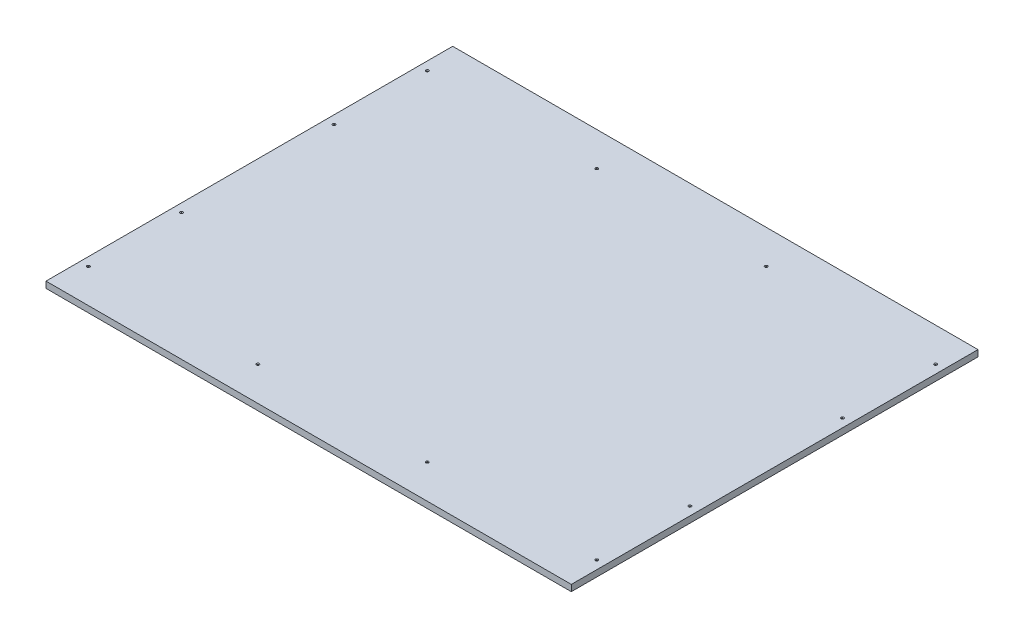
ISO-10303-21;
HEADER;
FILE_DESCRIPTION(('STEP AP214'),'2;1');
FILE_NAME('part.step','',(''),(''),'','','');
FILE_SCHEMA(('AUTOMOTIVE_DESIGN { 1 0 10303 214 1 1 1 1 }'));
ENDSEC;
DATA;
#1=APPLICATION_CONTEXT('core data for automotive mechanical design processes');
#2=APPLICATION_PROTOCOL_DEFINITION('international standard','automotive_design',2000,#1);
#3=PRODUCT_CONTEXT('',#1,'mechanical');
#4=PRODUCT('Part','Part','',(#3));
#5=PRODUCT_RELATED_PRODUCT_CATEGORY('part','',(#4));
#6=PRODUCT_DEFINITION_FORMATION('','',#4);
#7=PRODUCT_DEFINITION_CONTEXT('part definition',#1,'design');
#8=PRODUCT_DEFINITION('design','',#6,#7);
#9=PRODUCT_DEFINITION_SHAPE('','',#8);
#10=(LENGTH_UNIT() NAMED_UNIT(*) SI_UNIT(.MILLI.,.METRE.));
#11=(NAMED_UNIT(*) PLANE_ANGLE_UNIT() SI_UNIT($,.RADIAN.));
#12=(NAMED_UNIT(*) SI_UNIT($,.STERADIAN.) SOLID_ANGLE_UNIT());
#13=UNCERTAINTY_MEASURE_WITH_UNIT(LENGTH_MEASURE(1.E-05),#10,'distance_accuracy_value','');
#14=(GEOMETRIC_REPRESENTATION_CONTEXT(3) GLOBAL_UNCERTAINTY_ASSIGNED_CONTEXT((#13)) GLOBAL_UNIT_ASSIGNED_CONTEXT((#10,
#11,#12)) REPRESENTATION_CONTEXT('',''));
#15=CARTESIAN_POINT('',(0.,0.,0.));
#16=DIRECTION('',(0.,0.,1.));
#17=DIRECTION('',(1.,0.,0.));
#18=AXIS2_PLACEMENT_3D('',#15,#16,#17);
#19=CARTESIAN_POINT('',(-1219.2,19.05,-609.6));
#20=DIRECTION('',(0.,0.,1.));
#21=DIRECTION('',(1.,0.,0.));
#22=AXIS2_PLACEMENT_3D('',#19,#20,#21);
#23=PLANE('',#22);
#24=DIRECTION('',(-1.,0.,0.));
#25=VECTOR('',#24,1.);
#26=CARTESIAN_POINT('',(-1219.2,19.05,-609.6));
#27=LINE('',#26,#25);
#28=CARTESIAN_POINT('',(355.6,19.05,-609.6));
#29=VERTEX_POINT('',#28);
#30=CARTESIAN_POINT('',(-1219.2,19.05,-609.6));
#31=VERTEX_POINT('',#30);
#32=EDGE_CURVE('E84',#29,#31,#27,.T.);
#33=ORIENTED_EDGE('',*,*,#32,.F.);
#34=DIRECTION('',(0.,1.,0.));
#35=VECTOR('',#34,1.);
#36=CARTESIAN_POINT('',(355.6,0.,-609.6));
#37=LINE('',#36,#35);
#38=CARTESIAN_POINT('',(355.6,0.,-609.6));
#39=VERTEX_POINT('',#38);
#40=EDGE_CURVE('E91',#39,#29,#37,.T.);
#41=ORIENTED_EDGE('',*,*,#40,.F.);
#42=DIRECTION('',(-1.,0.,0.));
#43=VECTOR('',#42,1.);
#44=CARTESIAN_POINT('',(-1219.2,0.,-609.6));
#45=LINE('',#44,#43);
#46=CARTESIAN_POINT('',(-1219.2,0.,-609.6));
#47=VERTEX_POINT('',#46);
#48=EDGE_CURVE('E76',#39,#47,#45,.T.);
#49=ORIENTED_EDGE('',*,*,#48,.T.);
#50=DIRECTION('',(0.,-1.,0.));
#51=VECTOR('',#50,1.);
#52=CARTESIAN_POINT('',(-1219.2,19.05,-609.6));
#53=LINE('',#52,#51);
#54=EDGE_CURVE('E11',#31,#47,#53,.T.);
#55=ORIENTED_EDGE('',*,*,#54,.F.);
#56=EDGE_LOOP('',(#33,#41,#49,#55));
#57=FACE_BOUND('',#56,.T.);
#58=ADVANCED_FACE('F32',(#57),#23,.F.);
#59=CARTESIAN_POINT('',(-1219.2,19.05,-609.6));
#60=DIRECTION('',(1.,0.,0.));
#61=DIRECTION('',(0.,0.,-1.));
#62=AXIS2_PLACEMENT_3D('',#59,#60,#61);
#63=PLANE('',#62);
#64=DIRECTION('',(0.,0.,1.));
#65=VECTOR('',#64,1.);
#66=CARTESIAN_POINT('',(-1219.2,0.,-609.6));
#67=LINE('',#66,#65);
#68=CARTESIAN_POINT('',(-1219.2,0.,609.6));
#69=VERTEX_POINT('',#68);
#70=EDGE_CURVE('E67',#47,#69,#67,.T.);
#71=ORIENTED_EDGE('',*,*,#70,.T.);
#72=DIRECTION('',(0.,-1.,0.));
#73=VECTOR('',#72,1.);
#74=CARTESIAN_POINT('',(-1219.2,19.05,609.6));
#75=LINE('',#74,#73);
#76=CARTESIAN_POINT('',(-1219.2,19.05,609.6));
#77=VERTEX_POINT('',#76);
#78=EDGE_CURVE('E39',#77,#69,#75,.T.);
#79=ORIENTED_EDGE('',*,*,#78,.F.);
#80=DIRECTION('',(0.,0.,1.));
#81=VECTOR('',#80,1.);
#82=CARTESIAN_POINT('',(-1219.2,19.05,-609.6));
#83=LINE('',#82,#81);
#84=EDGE_CURVE('E55',#31,#77,#83,.T.);
#85=ORIENTED_EDGE('',*,*,#84,.F.);
#86=ORIENTED_EDGE('',*,*,#54,.T.);
#87=EDGE_LOOP('',(#71,#79,#85,#86));
#88=FACE_BOUND('',#87,.T.);
#89=ADVANCED_FACE('F69',(#88),#63,.F.);
#90=CARTESIAN_POINT('',(-1219.2,19.05,609.6));
#91=DIRECTION('',(0.,0.,-1.));
#92=DIRECTION('',(-1.,0.,0.));
#93=AXIS2_PLACEMENT_3D('',#90,#91,#92);
#94=PLANE('',#93);
#95=DIRECTION('',(1.,0.,0.));
#96=VECTOR('',#95,1.);
#97=CARTESIAN_POINT('',(-1219.2,0.,609.6));
#98=LINE('',#97,#96);
#99=CARTESIAN_POINT('',(355.600000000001,0.,609.6));
#100=VERTEX_POINT('',#99);
#101=EDGE_CURVE('E75',#69,#100,#98,.T.);
#102=ORIENTED_EDGE('',*,*,#101,.T.);
#103=DIRECTION('',(0.,1.,0.));
#104=VECTOR('',#103,1.);
#105=CARTESIAN_POINT('',(355.600000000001,0.,609.6));
#106=LINE('',#105,#104);
#107=CARTESIAN_POINT('',(355.600000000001,19.05,609.6));
#108=VERTEX_POINT('',#107);
#109=EDGE_CURVE('E46',#100,#108,#106,.T.);
#110=ORIENTED_EDGE('',*,*,#109,.T.);
#111=DIRECTION('',(1.,0.,0.));
#112=VECTOR('',#111,1.);
#113=CARTESIAN_POINT('',(-1219.2,19.05,609.6));
#114=LINE('',#113,#112);
#115=EDGE_CURVE('E81',#77,#108,#114,.T.);
#116=ORIENTED_EDGE('',*,*,#115,.F.);
#117=ORIENTED_EDGE('',*,*,#78,.T.);
#118=EDGE_LOOP('',(#102,#110,#116,#117));
#119=FACE_BOUND('',#118,.T.);
#120=ADVANCED_FACE('F80',(#119),#94,.F.);
#121=CARTESIAN_POINT('',(0.,19.05,0.));
#122=DIRECTION('',(0.,1.,0.));
#123=DIRECTION('',(0.,0.,1.));
#124=AXIS2_PLACEMENT_3D('',#121,#122,#123);
#125=PLANE('',#124);
#126=CARTESIAN_POINT('',(-1193.8,19.05,508.));
#127=DIRECTION('',(0.,1.,0.));
#128=DIRECTION('',(0.,0.,1.));
#129=AXIS2_PLACEMENT_3D('',#126,#127,#128);
#130=CIRCLE('',#129,4.21640000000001);
#131=CARTESIAN_POINT('',(-1193.8,19.05,512.2164));
#132=VERTEX_POINT('',#131);
#133=EDGE_CURVE('E203',#132,#132,#130,.T.);
#134=ORIENTED_EDGE('',*,*,#133,.F.);
#135=EDGE_LOOP('',(#134));
#136=FACE_BOUND('',#135,.T.);
#137=CARTESIAN_POINT('',(-685.8,19.05,508.));
#138=DIRECTION('',(0.,1.,0.));
#139=DIRECTION('',(0.,0.,1.));
#140=AXIS2_PLACEMENT_3D('',#137,#138,#139);
#141=CIRCLE('',#140,4.21640000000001);
#142=CARTESIAN_POINT('',(-685.8,19.05,512.2164));
#143=VERTEX_POINT('',#142);
#144=EDGE_CURVE('E194',#143,#143,#141,.T.);
#145=ORIENTED_EDGE('',*,*,#144,.F.);
#146=EDGE_LOOP('',(#145));
#147=FACE_BOUND('',#146,.T.);
#148=CARTESIAN_POINT('',(-177.8,19.05,508.));
#149=DIRECTION('',(0.,1.,0.));
#150=DIRECTION('',(0.,0.,1.));
#151=AXIS2_PLACEMENT_3D('',#148,#149,#150);
#152=CIRCLE('',#151,4.21640000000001);
#153=CARTESIAN_POINT('',(-177.8,19.05,512.2164));
#154=VERTEX_POINT('',#153);
#155=EDGE_CURVE('E185',#154,#154,#152,.T.);
#156=ORIENTED_EDGE('',*,*,#155,.F.);
#157=EDGE_LOOP('',(#156));
#158=FACE_BOUND('',#157,.T.);
#159=CARTESIAN_POINT('',(330.2,19.05,508.));
#160=DIRECTION('',(0.,1.,0.));
#161=DIRECTION('',(0.,0.,1.));
#162=AXIS2_PLACEMENT_3D('',#159,#160,#161);
#163=CIRCLE('',#162,4.21640000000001);
#164=CARTESIAN_POINT('',(330.2,19.05,512.2164));
#165=VERTEX_POINT('',#164);
#166=EDGE_CURVE('E176',#165,#165,#163,.T.);
#167=ORIENTED_EDGE('',*,*,#166,.F.);
#168=EDGE_LOOP('',(#167));
#169=FACE_BOUND('',#168,.T.);
#170=CARTESIAN_POINT('',(-1193.8,19.05,-228.6));
#171=DIRECTION('',(0.,1.,0.));
#172=DIRECTION('',(0.,0.,1.));
#173=AXIS2_PLACEMENT_3D('',#170,#171,#172);
#174=CIRCLE('',#173,4.21640000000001);
#175=CARTESIAN_POINT('',(-1193.8,19.05,-224.3836));
#176=VERTEX_POINT('',#175);
#177=EDGE_CURVE('E167',#176,#176,#174,.T.);
#178=ORIENTED_EDGE('',*,*,#177,.F.);
#179=EDGE_LOOP('',(#178));
#180=FACE_BOUND('',#179,.T.);
#181=CARTESIAN_POINT('',(-1193.8,19.05,228.6));
#182=DIRECTION('',(0.,1.,0.));
#183=DIRECTION('',(0.,0.,1.));
#184=AXIS2_PLACEMENT_3D('',#181,#182,#183);
#185=CIRCLE('',#184,4.21640000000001);
#186=CARTESIAN_POINT('',(-1193.8,19.05,232.8164));
#187=VERTEX_POINT('',#186);
#188=EDGE_CURVE('E158',#187,#187,#185,.T.);
#189=ORIENTED_EDGE('',*,*,#188,.F.);
#190=EDGE_LOOP('',(#189));
#191=FACE_BOUND('',#190,.T.);
#192=CARTESIAN_POINT('',(330.200000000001,19.05,228.6));
#193=DIRECTION('',(0.,1.,0.));
#194=DIRECTION('',(0.,0.,1.));
#195=AXIS2_PLACEMENT_3D('',#192,#193,#194);
#196=CIRCLE('',#195,4.21640000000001);
#197=CARTESIAN_POINT('',(330.200000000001,19.05,232.8164));
#198=VERTEX_POINT('',#197);
#199=EDGE_CURVE('E149',#198,#198,#196,.T.);
#200=ORIENTED_EDGE('',*,*,#199,.F.);
#201=EDGE_LOOP('',(#200));
#202=FACE_BOUND('',#201,.T.);
#203=CARTESIAN_POINT('',(330.2,19.05,-228.6));
#204=DIRECTION('',(0.,1.,0.));
#205=DIRECTION('',(0.,0.,1.));
#206=AXIS2_PLACEMENT_3D('',#203,#204,#205);
#207=CIRCLE('',#206,4.21640000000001);
#208=CARTESIAN_POINT('',(330.2,19.05,-224.3836));
#209=VERTEX_POINT('',#208);
#210=EDGE_CURVE('E140',#209,#209,#207,.T.);
#211=ORIENTED_EDGE('',*,*,#210,.F.);
#212=EDGE_LOOP('',(#211));
#213=FACE_BOUND('',#212,.T.);
#214=CARTESIAN_POINT('',(-1193.8,19.05,-508.));
#215=DIRECTION('',(0.,1.,0.));
#216=DIRECTION('',(0.,0.,1.));
#217=AXIS2_PLACEMENT_3D('',#214,#215,#216);
#218=CIRCLE('',#217,4.21640000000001);
#219=CARTESIAN_POINT('',(-1193.8,19.05,-503.7836));
#220=VERTEX_POINT('',#219);
#221=EDGE_CURVE('E131',#220,#220,#218,.T.);
#222=ORIENTED_EDGE('',*,*,#221,.F.);
#223=EDGE_LOOP('',(#222));
#224=FACE_BOUND('',#223,.T.);
#225=CARTESIAN_POINT('',(-685.8,19.05,-508.));
#226=DIRECTION('',(0.,1.,0.));
#227=DIRECTION('',(0.,0.,1.));
#228=AXIS2_PLACEMENT_3D('',#225,#226,#227);
#229=CIRCLE('',#228,4.21640000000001);
#230=CARTESIAN_POINT('',(-685.8,19.05,-503.7836));
#231=VERTEX_POINT('',#230);
#232=EDGE_CURVE('E122',#231,#231,#229,.T.);
#233=ORIENTED_EDGE('',*,*,#232,.F.);
#234=EDGE_LOOP('',(#233));
#235=FACE_BOUND('',#234,.T.);
#236=CARTESIAN_POINT('',(-177.8,19.05,-508.));
#237=DIRECTION('',(0.,1.,0.));
#238=DIRECTION('',(0.,0.,1.));
#239=AXIS2_PLACEMENT_3D('',#236,#237,#238);
#240=CIRCLE('',#239,4.21640000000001);
#241=CARTESIAN_POINT('',(-177.8,19.05,-503.7836));
#242=VERTEX_POINT('',#241);
#243=EDGE_CURVE('E113',#242,#242,#240,.T.);
#244=ORIENTED_EDGE('',*,*,#243,.F.);
#245=EDGE_LOOP('',(#244));
#246=FACE_BOUND('',#245,.T.);
#247=CARTESIAN_POINT('',(330.2,19.05,-508.));
#248=DIRECTION('',(0.,1.,0.));
#249=DIRECTION('',(0.,0.,1.));
#250=AXIS2_PLACEMENT_3D('',#247,#248,#249);
#251=CIRCLE('',#250,4.21640000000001);
#252=CARTESIAN_POINT('',(330.2,19.05,-503.7836));
#253=VERTEX_POINT('',#252);
#254=EDGE_CURVE('E104',#253,#253,#251,.T.);
#255=ORIENTED_EDGE('',*,*,#254,.F.);
#256=EDGE_LOOP('',(#255));
#257=FACE_BOUND('',#256,.T.);
#258=DIRECTION('',(0.,0.,1.));
#259=VECTOR('',#258,1.);
#260=CARTESIAN_POINT('',(355.6,19.05,-609.6));
#261=LINE('',#260,#259);
#262=EDGE_CURVE('E95',#29,#108,#261,.T.);
#263=ORIENTED_EDGE('',*,*,#262,.F.);
#264=ORIENTED_EDGE('',*,*,#32,.T.);
#265=ORIENTED_EDGE('',*,*,#84,.T.);
#266=ORIENTED_EDGE('',*,*,#115,.T.);
#267=EDGE_LOOP('',(#263,#264,#265,#266));
#268=FACE_BOUND('',#267,.T.);
#269=ADVANCED_FACE('F209',(#136,#147,#158,#169,#180,#191,#202,#213,#224,#235,#246,#257,#268),
#125,.T.);
#270=CARTESIAN_POINT('',(0.,0.,0.));
#271=DIRECTION('',(0.,1.,0.));
#272=DIRECTION('',(0.,0.,1.));
#273=AXIS2_PLACEMENT_3D('',#270,#271,#272);
#274=PLANE('',#273);
#275=CARTESIAN_POINT('',(-1193.8,0.,508.));
#276=DIRECTION('',(0.,1.,0.));
#277=DIRECTION('',(0.,0.,1.));
#278=AXIS2_PLACEMENT_3D('',#275,#276,#277);
#279=CIRCLE('',#278,2.24789999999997);
#280=CARTESIAN_POINT('',(-1193.8,0.,510.2479));
#281=VERTEX_POINT('',#280);
#282=EDGE_CURVE('E197',#281,#281,#279,.T.);
#283=ORIENTED_EDGE('',*,*,#282,.T.);
#284=EDGE_LOOP('',(#283));
#285=FACE_BOUND('',#284,.T.);
#286=CARTESIAN_POINT('',(-685.8,0.,508.));
#287=DIRECTION('',(0.,1.,0.));
#288=DIRECTION('',(0.,0.,1.));
#289=AXIS2_PLACEMENT_3D('',#286,#287,#288);
#290=CIRCLE('',#289,2.24789999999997);
#291=CARTESIAN_POINT('',(-685.8,0.,510.2479));
#292=VERTEX_POINT('',#291);
#293=EDGE_CURVE('E188',#292,#292,#290,.T.);
#294=ORIENTED_EDGE('',*,*,#293,.T.);
#295=EDGE_LOOP('',(#294));
#296=FACE_BOUND('',#295,.T.);
#297=CARTESIAN_POINT('',(-177.8,0.,508.));
#298=DIRECTION('',(0.,1.,0.));
#299=DIRECTION('',(0.,0.,1.));
#300=AXIS2_PLACEMENT_3D('',#297,#298,#299);
#301=CIRCLE('',#300,2.2479);
#302=CARTESIAN_POINT('',(-177.8,0.,510.2479));
#303=VERTEX_POINT('',#302);
#304=EDGE_CURVE('E179',#303,#303,#301,.T.);
#305=ORIENTED_EDGE('',*,*,#304,.T.);
#306=EDGE_LOOP('',(#305));
#307=FACE_BOUND('',#306,.T.);
#308=CARTESIAN_POINT('',(330.2,0.,508.));
#309=DIRECTION('',(0.,1.,0.));
#310=DIRECTION('',(0.,0.,1.));
#311=AXIS2_PLACEMENT_3D('',#308,#309,#310);
#312=CIRCLE('',#311,2.24789999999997);
#313=CARTESIAN_POINT('',(330.2,0.,510.2479));
#314=VERTEX_POINT('',#313);
#315=EDGE_CURVE('E170',#314,#314,#312,.T.);
#316=ORIENTED_EDGE('',*,*,#315,.T.);
#317=EDGE_LOOP('',(#316));
#318=FACE_BOUND('',#317,.T.);
#319=CARTESIAN_POINT('',(-1193.8,0.,-228.6));
#320=DIRECTION('',(0.,1.,0.));
#321=DIRECTION('',(0.,0.,1.));
#322=AXIS2_PLACEMENT_3D('',#319,#320,#321);
#323=CIRCLE('',#322,2.24789999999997);
#324=CARTESIAN_POINT('',(-1193.8,0.,-226.3521));
#325=VERTEX_POINT('',#324);
#326=EDGE_CURVE('E161',#325,#325,#323,.T.);
#327=ORIENTED_EDGE('',*,*,#326,.T.);
#328=EDGE_LOOP('',(#327));
#329=FACE_BOUND('',#328,.T.);
#330=CARTESIAN_POINT('',(-1193.8,0.,228.6));
#331=DIRECTION('',(0.,1.,0.));
#332=DIRECTION('',(0.,0.,1.));
#333=AXIS2_PLACEMENT_3D('',#330,#331,#332);
#334=CIRCLE('',#333,2.24789999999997);
#335=CARTESIAN_POINT('',(-1193.8,0.,230.8479));
#336=VERTEX_POINT('',#335);
#337=EDGE_CURVE('E152',#336,#336,#334,.T.);
#338=ORIENTED_EDGE('',*,*,#337,.T.);
#339=EDGE_LOOP('',(#338));
#340=FACE_BOUND('',#339,.T.);
#341=CARTESIAN_POINT('',(330.200000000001,0.,228.6));
#342=DIRECTION('',(0.,1.,0.));
#343=DIRECTION('',(0.,0.,1.));
#344=AXIS2_PLACEMENT_3D('',#341,#342,#343);
#345=CIRCLE('',#344,2.24789999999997);
#346=CARTESIAN_POINT('',(330.200000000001,0.,230.8479));
#347=VERTEX_POINT('',#346);
#348=EDGE_CURVE('E143',#347,#347,#345,.T.);
#349=ORIENTED_EDGE('',*,*,#348,.T.);
#350=EDGE_LOOP('',(#349));
#351=FACE_BOUND('',#350,.T.);
#352=CARTESIAN_POINT('',(330.2,0.,-228.6));
#353=DIRECTION('',(0.,1.,0.));
#354=DIRECTION('',(0.,0.,1.));
#355=AXIS2_PLACEMENT_3D('',#352,#353,#354);
#356=CIRCLE('',#355,2.24789999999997);
#357=CARTESIAN_POINT('',(330.2,0.,-226.3521));
#358=VERTEX_POINT('',#357);
#359=EDGE_CURVE('E134',#358,#358,#356,.T.);
#360=ORIENTED_EDGE('',*,*,#359,.T.);
#361=EDGE_LOOP('',(#360));
#362=FACE_BOUND('',#361,.T.);
#363=CARTESIAN_POINT('',(-1193.8,0.,-508.));
#364=DIRECTION('',(0.,1.,0.));
#365=DIRECTION('',(0.,0.,1.));
#366=AXIS2_PLACEMENT_3D('',#363,#364,#365);
#367=CIRCLE('',#366,2.24789999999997);
#368=CARTESIAN_POINT('',(-1193.8,0.,-505.7521));
#369=VERTEX_POINT('',#368);
#370=EDGE_CURVE('E125',#369,#369,#367,.T.);
#371=ORIENTED_EDGE('',*,*,#370,.T.);
#372=EDGE_LOOP('',(#371));
#373=FACE_BOUND('',#372,.T.);
#374=CARTESIAN_POINT('',(-685.8,0.,-508.));
#375=DIRECTION('',(0.,1.,0.));
#376=DIRECTION('',(0.,0.,1.));
#377=AXIS2_PLACEMENT_3D('',#374,#375,#376);
#378=CIRCLE('',#377,2.24789999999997);
#379=CARTESIAN_POINT('',(-685.8,0.,-505.7521));
#380=VERTEX_POINT('',#379);
#381=EDGE_CURVE('E116',#380,#380,#378,.T.);
#382=ORIENTED_EDGE('',*,*,#381,.T.);
#383=EDGE_LOOP('',(#382));
#384=FACE_BOUND('',#383,.T.);
#385=CARTESIAN_POINT('',(-177.8,0.,-508.));
#386=DIRECTION('',(0.,1.,0.));
#387=DIRECTION('',(0.,0.,1.));
#388=AXIS2_PLACEMENT_3D('',#385,#386,#387);
#389=CIRCLE('',#388,2.2479);
#390=CARTESIAN_POINT('',(-177.8,0.,-505.7521));
#391=VERTEX_POINT('',#390);
#392=EDGE_CURVE('E107',#391,#391,#389,.T.);
#393=ORIENTED_EDGE('',*,*,#392,.T.);
#394=EDGE_LOOP('',(#393));
#395=FACE_BOUND('',#394,.T.);
#396=CARTESIAN_POINT('',(330.2,0.,-508.));
#397=DIRECTION('',(0.,1.,0.));
#398=DIRECTION('',(0.,0.,1.));
#399=AXIS2_PLACEMENT_3D('',#396,#397,#398);
#400=CIRCLE('',#399,2.24789999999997);
#401=CARTESIAN_POINT('',(330.2,0.,-505.7521));
#402=VERTEX_POINT('',#401);
#403=EDGE_CURVE('E97',#402,#402,#400,.T.);
#404=ORIENTED_EDGE('',*,*,#403,.T.);
#405=EDGE_LOOP('',(#404));
#406=FACE_BOUND('',#405,.T.);
#407=ORIENTED_EDGE('',*,*,#48,.F.);
#408=DIRECTION('',(0.,0.,1.));
#409=VECTOR('',#408,1.);
#410=CARTESIAN_POINT('',(355.6,0.,-609.6));
#411=LINE('',#410,#409);
#412=EDGE_CURVE('E83',#39,#100,#411,.T.);
#413=ORIENTED_EDGE('',*,*,#412,.T.);
#414=ORIENTED_EDGE('',*,*,#101,.F.);
#415=ORIENTED_EDGE('',*,*,#70,.F.);
#416=EDGE_LOOP('',(#407,#413,#414,#415));
#417=FACE_BOUND('',#416,.T.);
#418=ADVANCED_FACE('F82',(#285,#296,#307,#318,#329,#340,#351,#362,#373,#384,#395,#406,#417),
#274,.F.);
#419=CARTESIAN_POINT('',(355.6,0.,-609.6));
#420=DIRECTION('',(-1.,0.,0.));
#421=DIRECTION('',(0.,0.,1.));
#422=AXIS2_PLACEMENT_3D('',#419,#420,#421);
#423=PLANE('',#422);
#424=ORIENTED_EDGE('',*,*,#262,.T.);
#425=ORIENTED_EDGE('',*,*,#109,.F.);
#426=ORIENTED_EDGE('',*,*,#412,.F.);
#427=ORIENTED_EDGE('',*,*,#40,.T.);
#428=EDGE_LOOP('',(#424,#425,#426,#427));
#429=FACE_BOUND('',#428,.T.);
#430=ADVANCED_FACE('F242',(#429),#423,.F.);
#431=CARTESIAN_POINT('',(330.2,19.05,-508.));
#432=DIRECTION('',(0.,1.,0.));
#433=DIRECTION('',(0.,0.,1.));
#434=AXIS2_PLACEMENT_3D('',#431,#432,#433);
#435=CYLINDRICAL_SURFACE('',#434,2.24789999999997);
#436=ORIENTED_EDGE('',*,*,#403,.F.);
#437=EDGE_LOOP('',(#436));
#438=FACE_BOUND('',#437,.T.);
#439=CARTESIAN_POINT('',(330.2,17.3982323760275,-508.));
#440=DIRECTION('',(0.,1.,0.));
#441=DIRECTION('',(0.,0.,1.));
#442=AXIS2_PLACEMENT_3D('',#439,#440,#441);
#443=CIRCLE('',#442,2.24789999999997);
#444=CARTESIAN_POINT('',(330.2,17.3982323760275,-505.7521));
#445=VERTEX_POINT('',#444);
#446=EDGE_CURVE('E101',#445,#445,#443,.T.);
#447=ORIENTED_EDGE('',*,*,#446,.T.);
#448=EDGE_LOOP('',(#447));
#449=FACE_BOUND('',#448,.T.);
#450=ADVANCED_FACE('F244',(#438,#449),#435,.F.);
#451=CARTESIAN_POINT('',(330.2,19.05,-508.));
#452=DIRECTION('',(0.,1.,0.));
#453=DIRECTION('',(0.,0.,1.));
#454=AXIS2_PLACEMENT_3D('',#451,#452,#453);
#455=CONICAL_SURFACE('',#454,4.21640000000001,0.872664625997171);
#456=ORIENTED_EDGE('',*,*,#446,.F.);
#457=EDGE_LOOP('',(#456));
#458=FACE_BOUND('',#457,.T.);
#459=ORIENTED_EDGE('',*,*,#254,.T.);
#460=EDGE_LOOP('',(#459));
#461=FACE_BOUND('',#460,.T.);
#462=ADVANCED_FACE('F250',(#458,#461),#455,.F.);
#463=CARTESIAN_POINT('',(-177.8,19.05,-508.));
#464=DIRECTION('',(0.,1.,0.));
#465=DIRECTION('',(0.,0.,1.));
#466=AXIS2_PLACEMENT_3D('',#463,#464,#465);
#467=CYLINDRICAL_SURFACE('',#466,2.2479);
#468=ORIENTED_EDGE('',*,*,#392,.F.);
#469=EDGE_LOOP('',(#468));
#470=FACE_BOUND('',#469,.T.);
#471=CARTESIAN_POINT('',(-177.8,17.3982323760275,-508.));
#472=DIRECTION('',(0.,1.,0.));
#473=DIRECTION('',(0.,0.,1.));
#474=AXIS2_PLACEMENT_3D('',#471,#472,#473);
#475=CIRCLE('',#474,2.2479);
#476=CARTESIAN_POINT('',(-177.8,17.3982323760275,-505.7521));
#477=VERTEX_POINT('',#476);
#478=EDGE_CURVE('E110',#477,#477,#475,.T.);
#479=ORIENTED_EDGE('',*,*,#478,.T.);
#480=EDGE_LOOP('',(#479));
#481=FACE_BOUND('',#480,.T.);
#482=ADVANCED_FACE('F460',(#470,#481),#467,.F.);
#483=CARTESIAN_POINT('',(-177.8,19.05,-508.));
#484=DIRECTION('',(0.,1.,0.));
#485=DIRECTION('',(0.,0.,1.));
#486=AXIS2_PLACEMENT_3D('',#483,#484,#485);
#487=CONICAL_SURFACE('',#486,4.21640000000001,0.872664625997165);
#488=ORIENTED_EDGE('',*,*,#478,.F.);
#489=EDGE_LOOP('',(#488));
#490=FACE_BOUND('',#489,.T.);
#491=ORIENTED_EDGE('',*,*,#243,.T.);
#492=EDGE_LOOP('',(#491));
#493=FACE_BOUND('',#492,.T.);
#494=ADVANCED_FACE('F456',(#490,#493),#487,.F.);
#495=CARTESIAN_POINT('',(-685.8,19.05,-508.));
#496=DIRECTION('',(0.,1.,0.));
#497=DIRECTION('',(0.,0.,1.));
#498=AXIS2_PLACEMENT_3D('',#495,#496,#497);
#499=CYLINDRICAL_SURFACE('',#498,2.24789999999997);
#500=ORIENTED_EDGE('',*,*,#381,.F.);
#501=EDGE_LOOP('',(#500));
#502=FACE_BOUND('',#501,.T.);
#503=CARTESIAN_POINT('',(-685.8,17.3982323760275,-508.));
#504=DIRECTION('',(0.,1.,0.));
#505=DIRECTION('',(0.,0.,1.));
#506=AXIS2_PLACEMENT_3D('',#503,#504,#505);
#507=CIRCLE('',#506,2.24789999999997);
#508=CARTESIAN_POINT('',(-685.8,17.3982323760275,-505.7521));
#509=VERTEX_POINT('',#508);
#510=EDGE_CURVE('E119',#509,#509,#507,.T.);
#511=ORIENTED_EDGE('',*,*,#510,.T.);
#512=EDGE_LOOP('',(#511));
#513=FACE_BOUND('',#512,.T.);
#514=ADVANCED_FACE('F452',(#502,#513),#499,.F.);
#515=CARTESIAN_POINT('',(-685.8,19.05,-508.));
#516=DIRECTION('',(0.,1.,0.));
#517=DIRECTION('',(0.,0.,1.));
#518=AXIS2_PLACEMENT_3D('',#515,#516,#517);
#519=CONICAL_SURFACE('',#518,4.21640000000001,0.872664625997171);
#520=ORIENTED_EDGE('',*,*,#510,.F.);
#521=EDGE_LOOP('',(#520));
#522=FACE_BOUND('',#521,.T.);
#523=ORIENTED_EDGE('',*,*,#232,.T.);
#524=EDGE_LOOP('',(#523));
#525=FACE_BOUND('',#524,.T.);
#526=ADVANCED_FACE('F448',(#522,#525),#519,.F.);
#527=CARTESIAN_POINT('',(-1193.8,19.05,-508.));
#528=DIRECTION('',(0.,1.,0.));
#529=DIRECTION('',(0.,0.,1.));
#530=AXIS2_PLACEMENT_3D('',#527,#528,#529);
#531=CYLINDRICAL_SURFACE('',#530,2.24789999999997);
#532=ORIENTED_EDGE('',*,*,#370,.F.);
#533=EDGE_LOOP('',(#532));
#534=FACE_BOUND('',#533,.T.);
#535=CARTESIAN_POINT('',(-1193.8,17.3982323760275,-508.));
#536=DIRECTION('',(0.,1.,0.));
#537=DIRECTION('',(0.,0.,1.));
#538=AXIS2_PLACEMENT_3D('',#535,#536,#537);
#539=CIRCLE('',#538,2.24789999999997);
#540=CARTESIAN_POINT('',(-1193.8,17.3982323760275,-505.7521));
#541=VERTEX_POINT('',#540);
#542=EDGE_CURVE('E128',#541,#541,#539,.T.);
#543=ORIENTED_EDGE('',*,*,#542,.T.);
#544=EDGE_LOOP('',(#543));
#545=FACE_BOUND('',#544,.T.);
#546=ADVANCED_FACE('F444',(#534,#545),#531,.F.);
#547=CARTESIAN_POINT('',(-1193.8,19.05,-508.));
#548=DIRECTION('',(0.,1.,0.));
#549=DIRECTION('',(0.,0.,1.));
#550=AXIS2_PLACEMENT_3D('',#547,#548,#549);
#551=CONICAL_SURFACE('',#550,4.21640000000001,0.872664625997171);
#552=ORIENTED_EDGE('',*,*,#542,.F.);
#553=EDGE_LOOP('',(#552));
#554=FACE_BOUND('',#553,.T.);
#555=ORIENTED_EDGE('',*,*,#221,.T.);
#556=EDGE_LOOP('',(#555));
#557=FACE_BOUND('',#556,.T.);
#558=ADVANCED_FACE('F286',(#554,#557),#551,.F.);
#559=CARTESIAN_POINT('',(330.2,19.05,-228.6));
#560=DIRECTION('',(0.,1.,0.));
#561=DIRECTION('',(0.,0.,1.));
#562=AXIS2_PLACEMENT_3D('',#559,#560,#561);
#563=CYLINDRICAL_SURFACE('',#562,2.24789999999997);
#564=ORIENTED_EDGE('',*,*,#359,.F.);
#565=EDGE_LOOP('',(#564));
#566=FACE_BOUND('',#565,.T.);
#567=CARTESIAN_POINT('',(330.2,17.3982323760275,-228.6));
#568=DIRECTION('',(0.,1.,0.));
#569=DIRECTION('',(0.,0.,1.));
#570=AXIS2_PLACEMENT_3D('',#567,#568,#569);
#571=CIRCLE('',#570,2.24789999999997);
#572=CARTESIAN_POINT('',(330.2,17.3982323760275,-226.3521));
#573=VERTEX_POINT('',#572);
#574=EDGE_CURVE('E137',#573,#573,#571,.T.);
#575=ORIENTED_EDGE('',*,*,#574,.T.);
#576=EDGE_LOOP('',(#575));
#577=FACE_BOUND('',#576,.T.);
#578=ADVANCED_FACE('F280',(#566,#577),#563,.F.);
#579=CARTESIAN_POINT('',(330.2,19.05,-228.6));
#580=DIRECTION('',(0.,1.,0.));
#581=DIRECTION('',(0.,0.,1.));
#582=AXIS2_PLACEMENT_3D('',#579,#580,#581);
#583=CONICAL_SURFACE('',#582,4.21640000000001,0.872664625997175);
#584=ORIENTED_EDGE('',*,*,#574,.F.);
#585=EDGE_LOOP('',(#584));
#586=FACE_BOUND('',#585,.T.);
#587=ORIENTED_EDGE('',*,*,#210,.T.);
#588=EDGE_LOOP('',(#587));
#589=FACE_BOUND('',#588,.T.);
#590=ADVANCED_FACE('F285',(#586,#589),#583,.F.);
#591=CARTESIAN_POINT('',(330.200000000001,19.05,228.6));
#592=DIRECTION('',(0.,1.,0.));
#593=DIRECTION('',(0.,0.,1.));
#594=AXIS2_PLACEMENT_3D('',#591,#592,#593);
#595=CYLINDRICAL_SURFACE('',#594,2.24789999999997);
#596=ORIENTED_EDGE('',*,*,#348,.F.);
#597=EDGE_LOOP('',(#596));
#598=FACE_BOUND('',#597,.T.);
#599=CARTESIAN_POINT('',(330.200000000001,17.3982323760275,228.6));
#600=DIRECTION('',(0.,1.,0.));
#601=DIRECTION('',(0.,0.,1.));
#602=AXIS2_PLACEMENT_3D('',#599,#600,#601);
#603=CIRCLE('',#602,2.24789999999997);
#604=CARTESIAN_POINT('',(330.200000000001,17.3982323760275,230.8479));
#605=VERTEX_POINT('',#604);
#606=EDGE_CURVE('E146',#605,#605,#603,.T.);
#607=ORIENTED_EDGE('',*,*,#606,.T.);
#608=EDGE_LOOP('',(#607));
#609=FACE_BOUND('',#608,.T.);
#610=ADVANCED_FACE('F298',(#598,#609),#595,.F.);
#611=CARTESIAN_POINT('',(330.200000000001,19.05,228.6));
#612=DIRECTION('',(0.,1.,0.));
#613=DIRECTION('',(0.,0.,1.));
#614=AXIS2_PLACEMENT_3D('',#611,#612,#613);
#615=CONICAL_SURFACE('',#614,4.21640000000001,0.872664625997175);
#616=ORIENTED_EDGE('',*,*,#606,.F.);
#617=EDGE_LOOP('',(#616));
#618=FACE_BOUND('',#617,.T.);
#619=ORIENTED_EDGE('',*,*,#199,.T.);
#620=EDGE_LOOP('',(#619));
#621=FACE_BOUND('',#620,.T.);
#622=ADVANCED_FACE('F308',(#618,#621),#615,.F.);
#623=CARTESIAN_POINT('',(-1193.8,19.05,228.6));
#624=DIRECTION('',(0.,1.,0.));
#625=DIRECTION('',(0.,0.,1.));
#626=AXIS2_PLACEMENT_3D('',#623,#624,#625);
#627=CYLINDRICAL_SURFACE('',#626,2.24789999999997);
#628=ORIENTED_EDGE('',*,*,#337,.F.);
#629=EDGE_LOOP('',(#628));
#630=FACE_BOUND('',#629,.T.);
#631=CARTESIAN_POINT('',(-1193.8,17.3982323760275,228.6));
#632=DIRECTION('',(0.,1.,0.));
#633=DIRECTION('',(0.,0.,1.));
#634=AXIS2_PLACEMENT_3D('',#631,#632,#633);
#635=CIRCLE('',#634,2.24789999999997);
#636=CARTESIAN_POINT('',(-1193.8,17.3982323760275,230.8479));
#637=VERTEX_POINT('',#636);
#638=EDGE_CURVE('E155',#637,#637,#635,.T.);
#639=ORIENTED_EDGE('',*,*,#638,.T.);
#640=EDGE_LOOP('',(#639));
#641=FACE_BOUND('',#640,.T.);
#642=ADVANCED_FACE('F318',(#630,#641),#627,.F.);
#643=CARTESIAN_POINT('',(-1193.8,19.05,228.6));
#644=DIRECTION('',(0.,1.,0.));
#645=DIRECTION('',(0.,0.,1.));
#646=AXIS2_PLACEMENT_3D('',#643,#644,#645);
#647=CONICAL_SURFACE('',#646,4.21640000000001,0.872664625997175);
#648=ORIENTED_EDGE('',*,*,#638,.F.);
#649=EDGE_LOOP('',(#648));
#650=FACE_BOUND('',#649,.T.);
#651=ORIENTED_EDGE('',*,*,#188,.T.);
#652=EDGE_LOOP('',(#651));
#653=FACE_BOUND('',#652,.T.);
#654=ADVANCED_FACE('F328',(#650,#653),#647,.F.);
#655=CARTESIAN_POINT('',(-1193.8,19.05,-228.6));
#656=DIRECTION('',(0.,1.,0.));
#657=DIRECTION('',(0.,0.,1.));
#658=AXIS2_PLACEMENT_3D('',#655,#656,#657);
#659=CYLINDRICAL_SURFACE('',#658,2.24789999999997);
#660=ORIENTED_EDGE('',*,*,#326,.F.);
#661=EDGE_LOOP('',(#660));
#662=FACE_BOUND('',#661,.T.);
#663=CARTESIAN_POINT('',(-1193.8,17.3982323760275,-228.6));
#664=DIRECTION('',(0.,1.,0.));
#665=DIRECTION('',(0.,0.,1.));
#666=AXIS2_PLACEMENT_3D('',#663,#664,#665);
#667=CIRCLE('',#666,2.24789999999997);
#668=CARTESIAN_POINT('',(-1193.8,17.3982323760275,-226.3521));
#669=VERTEX_POINT('',#668);
#670=EDGE_CURVE('E164',#669,#669,#667,.T.);
#671=ORIENTED_EDGE('',*,*,#670,.T.);
#672=EDGE_LOOP('',(#671));
#673=FACE_BOUND('',#672,.T.);
#674=ADVANCED_FACE('F338',(#662,#673),#659,.F.);
#675=CARTESIAN_POINT('',(-1193.8,19.05,-228.6));
#676=DIRECTION('',(0.,1.,0.));
#677=DIRECTION('',(0.,0.,1.));
#678=AXIS2_PLACEMENT_3D('',#675,#676,#677);
#679=CONICAL_SURFACE('',#678,4.21640000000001,0.872664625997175);
#680=ORIENTED_EDGE('',*,*,#670,.F.);
#681=EDGE_LOOP('',(#680));
#682=FACE_BOUND('',#681,.T.);
#683=ORIENTED_EDGE('',*,*,#177,.T.);
#684=EDGE_LOOP('',(#683));
#685=FACE_BOUND('',#684,.T.);
#686=ADVANCED_FACE('F348',(#682,#685),#679,.F.);
#687=CARTESIAN_POINT('',(330.2,19.05,508.));
#688=DIRECTION('',(0.,1.,0.));
#689=DIRECTION('',(0.,0.,1.));
#690=AXIS2_PLACEMENT_3D('',#687,#688,#689);
#691=CYLINDRICAL_SURFACE('',#690,2.24789999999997);
#692=ORIENTED_EDGE('',*,*,#315,.F.);
#693=EDGE_LOOP('',(#692));
#694=FACE_BOUND('',#693,.T.);
#695=CARTESIAN_POINT('',(330.2,17.3982323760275,508.));
#696=DIRECTION('',(0.,1.,0.));
#697=DIRECTION('',(0.,0.,1.));
#698=AXIS2_PLACEMENT_3D('',#695,#696,#697);
#699=CIRCLE('',#698,2.24789999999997);
#700=CARTESIAN_POINT('',(330.2,17.3982323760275,510.2479));
#701=VERTEX_POINT('',#700);
#702=EDGE_CURVE('E173',#701,#701,#699,.T.);
#703=ORIENTED_EDGE('',*,*,#702,.T.);
#704=EDGE_LOOP('',(#703));
#705=FACE_BOUND('',#704,.T.);
#706=ADVANCED_FACE('F358',(#694,#705),#691,.F.);
#707=CARTESIAN_POINT('',(330.2,19.05,508.));
#708=DIRECTION('',(0.,1.,0.));
#709=DIRECTION('',(0.,0.,1.));
#710=AXIS2_PLACEMENT_3D('',#707,#708,#709);
#711=CONICAL_SURFACE('',#710,4.21640000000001,0.872664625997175);
#712=ORIENTED_EDGE('',*,*,#702,.F.);
#713=EDGE_LOOP('',(#712));
#714=FACE_BOUND('',#713,.T.);
#715=ORIENTED_EDGE('',*,*,#166,.T.);
#716=EDGE_LOOP('',(#715));
#717=FACE_BOUND('',#716,.T.);
#718=ADVANCED_FACE('F368',(#714,#717),#711,.F.);
#719=CARTESIAN_POINT('',(-177.8,19.05,508.));
#720=DIRECTION('',(0.,1.,0.));
#721=DIRECTION('',(0.,0.,1.));
#722=AXIS2_PLACEMENT_3D('',#719,#720,#721);
#723=CYLINDRICAL_SURFACE('',#722,2.2479);
#724=ORIENTED_EDGE('',*,*,#304,.F.);
#725=EDGE_LOOP('',(#724));
#726=FACE_BOUND('',#725,.T.);
#727=CARTESIAN_POINT('',(-177.8,17.3982323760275,508.));
#728=DIRECTION('',(0.,1.,0.));
#729=DIRECTION('',(0.,0.,1.));
#730=AXIS2_PLACEMENT_3D('',#727,#728,#729);
#731=CIRCLE('',#730,2.2479);
#732=CARTESIAN_POINT('',(-177.8,17.3982323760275,510.2479));
#733=VERTEX_POINT('',#732);
#734=EDGE_CURVE('E182',#733,#733,#731,.T.);
#735=ORIENTED_EDGE('',*,*,#734,.T.);
#736=EDGE_LOOP('',(#735));
#737=FACE_BOUND('',#736,.T.);
#738=ADVANCED_FACE('F378',(#726,#737),#723,.F.);
#739=CARTESIAN_POINT('',(-177.8,19.05,508.));
#740=DIRECTION('',(0.,1.,0.));
#741=DIRECTION('',(0.,0.,1.));
#742=AXIS2_PLACEMENT_3D('',#739,#740,#741);
#743=CONICAL_SURFACE('',#742,4.21640000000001,0.872664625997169);
#744=ORIENTED_EDGE('',*,*,#734,.F.);
#745=EDGE_LOOP('',(#744));
#746=FACE_BOUND('',#745,.T.);
#747=ORIENTED_EDGE('',*,*,#155,.T.);
#748=EDGE_LOOP('',(#747));
#749=FACE_BOUND('',#748,.T.);
#750=ADVANCED_FACE('F388',(#746,#749),#743,.F.);
#751=CARTESIAN_POINT('',(-685.8,19.05,508.));
#752=DIRECTION('',(0.,1.,0.));
#753=DIRECTION('',(0.,0.,1.));
#754=AXIS2_PLACEMENT_3D('',#751,#752,#753);
#755=CYLINDRICAL_SURFACE('',#754,2.24789999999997);
#756=ORIENTED_EDGE('',*,*,#293,.F.);
#757=EDGE_LOOP('',(#756));
#758=FACE_BOUND('',#757,.T.);
#759=CARTESIAN_POINT('',(-685.8,17.3982323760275,508.));
#760=DIRECTION('',(0.,1.,0.));
#761=DIRECTION('',(0.,0.,1.));
#762=AXIS2_PLACEMENT_3D('',#759,#760,#761);
#763=CIRCLE('',#762,2.24789999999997);
#764=CARTESIAN_POINT('',(-685.8,17.3982323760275,510.2479));
#765=VERTEX_POINT('',#764);
#766=EDGE_CURVE('E191',#765,#765,#763,.T.);
#767=ORIENTED_EDGE('',*,*,#766,.T.);
#768=EDGE_LOOP('',(#767));
#769=FACE_BOUND('',#768,.T.);
#770=ADVANCED_FACE('F398',(#758,#769),#755,.F.);
#771=CARTESIAN_POINT('',(-685.8,19.05,508.));
#772=DIRECTION('',(0.,1.,0.));
#773=DIRECTION('',(0.,0.,1.));
#774=AXIS2_PLACEMENT_3D('',#771,#772,#773);
#775=CONICAL_SURFACE('',#774,4.21640000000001,0.872664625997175);
#776=ORIENTED_EDGE('',*,*,#766,.F.);
#777=EDGE_LOOP('',(#776));
#778=FACE_BOUND('',#777,.T.);
#779=ORIENTED_EDGE('',*,*,#144,.T.);
#780=EDGE_LOOP('',(#779));
#781=FACE_BOUND('',#780,.T.);
#782=ADVANCED_FACE('F408',(#778,#781),#775,.F.);
#783=CARTESIAN_POINT('',(-1193.8,19.05,508.));
#784=DIRECTION('',(0.,1.,0.));
#785=DIRECTION('',(0.,0.,1.));
#786=AXIS2_PLACEMENT_3D('',#783,#784,#785);
#787=CYLINDRICAL_SURFACE('',#786,2.24789999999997);
#788=ORIENTED_EDGE('',*,*,#282,.F.);
#789=EDGE_LOOP('',(#788));
#790=FACE_BOUND('',#789,.T.);
#791=CARTESIAN_POINT('',(-1193.8,17.3982323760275,508.));
#792=DIRECTION('',(0.,1.,0.));
#793=DIRECTION('',(0.,0.,1.));
#794=AXIS2_PLACEMENT_3D('',#791,#792,#793);
#795=CIRCLE('',#794,2.24789999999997);
#796=CARTESIAN_POINT('',(-1193.8,17.3982323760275,510.2479));
#797=VERTEX_POINT('',#796);
#798=EDGE_CURVE('E200',#797,#797,#795,.T.);
#799=ORIENTED_EDGE('',*,*,#798,.T.);
#800=EDGE_LOOP('',(#799));
#801=FACE_BOUND('',#800,.T.);
#802=ADVANCED_FACE('F418',(#790,#801),#787,.F.);
#803=CARTESIAN_POINT('',(-1193.8,19.05,508.));
#804=DIRECTION('',(0.,1.,0.));
#805=DIRECTION('',(0.,0.,1.));
#806=AXIS2_PLACEMENT_3D('',#803,#804,#805);
#807=CONICAL_SURFACE('',#806,4.21640000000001,0.872664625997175);
#808=ORIENTED_EDGE('',*,*,#798,.F.);
#809=EDGE_LOOP('',(#808));
#810=FACE_BOUND('',#809,.T.);
#811=ORIENTED_EDGE('',*,*,#133,.T.);
#812=EDGE_LOOP('',(#811));
#813=FACE_BOUND('',#812,.T.);
#814=ADVANCED_FACE('F207',(#810,#813),#807,.F.);
#815=CLOSED_SHELL('',(#58,#89,#120,#269,#418,#430,#450,#462,#482,#494,#514,#526,#546,#558,#578,
#590,#610,#622,#642,#654,#674,#686,#706,#718,#738,#750,#770,#782,#802,#814));
#816=MANIFOLD_SOLID_BREP('B2',#815);
#817=ADVANCED_BREP_SHAPE_REPRESENTATION('',(#18,#816),#14);
#818=SHAPE_DEFINITION_REPRESENTATION(#9,#817);
ENDSEC;
END-ISO-10303-21;
